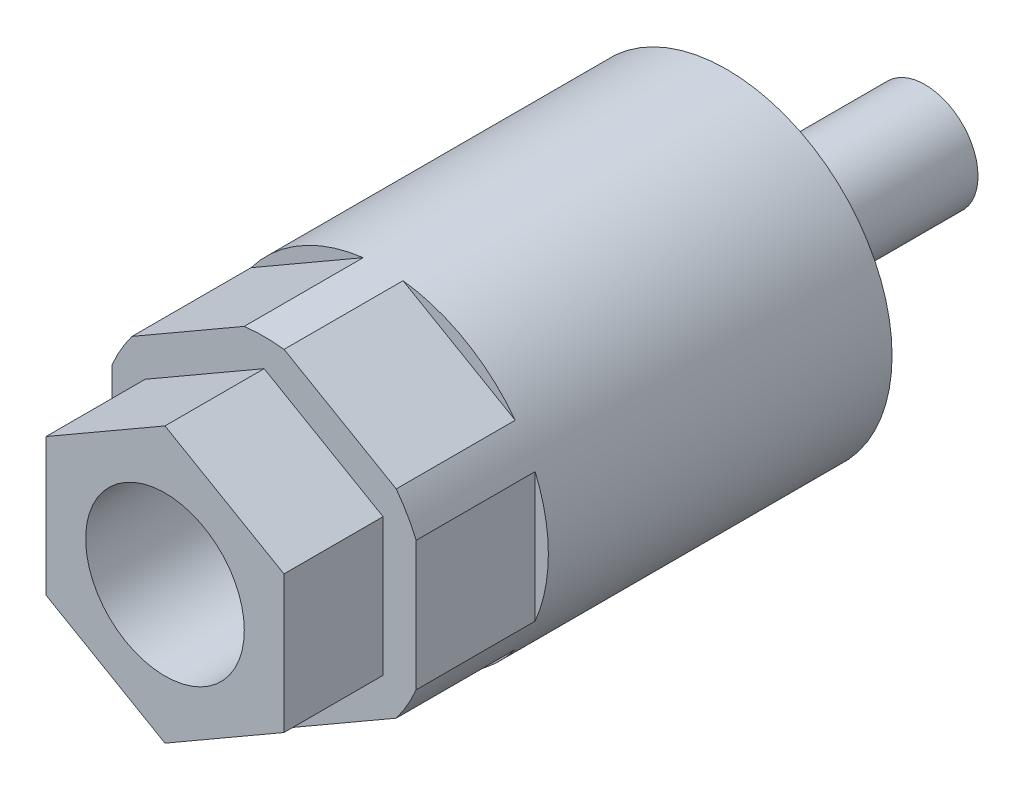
ISO-10303-21;
HEADER;
FILE_DESCRIPTION(('STEP AP214'),'2;1');
FILE_NAME('part.step','',(''),(''),'','','');
FILE_SCHEMA(('AUTOMOTIVE_DESIGN { 1 0 10303 214 1 1 1 1 }'));
ENDSEC;
DATA;
#1=APPLICATION_CONTEXT('core data for automotive mechanical design processes');
#2=APPLICATION_PROTOCOL_DEFINITION('international standard','automotive_design',2000,#1);
#3=PRODUCT_CONTEXT('',#1,'mechanical');
#4=PRODUCT('Part','Part','',(#3));
#5=PRODUCT_RELATED_PRODUCT_CATEGORY('part','',(#4));
#6=PRODUCT_DEFINITION_FORMATION('','',#4);
#7=PRODUCT_DEFINITION_CONTEXT('part definition',#1,'design');
#8=PRODUCT_DEFINITION('design','',#6,#7);
#9=PRODUCT_DEFINITION_SHAPE('','',#8);
#10=(LENGTH_UNIT() NAMED_UNIT(*) SI_UNIT(.MILLI.,.METRE.));
#11=(NAMED_UNIT(*) PLANE_ANGLE_UNIT() SI_UNIT($,.RADIAN.));
#12=(NAMED_UNIT(*) SI_UNIT($,.STERADIAN.) SOLID_ANGLE_UNIT());
#13=UNCERTAINTY_MEASURE_WITH_UNIT(LENGTH_MEASURE(1.E-05),#10,'distance_accuracy_value','');
#14=(GEOMETRIC_REPRESENTATION_CONTEXT(3) GLOBAL_UNCERTAINTY_ASSIGNED_CONTEXT((#13)) GLOBAL_UNIT_ASSIGNED_CONTEXT((#10,
#11,#12)) REPRESENTATION_CONTEXT('',''));
#15=CARTESIAN_POINT('',(0.,0.,0.));
#16=DIRECTION('',(0.,0.,1.));
#17=DIRECTION('',(1.,0.,0.));
#18=AXIS2_PLACEMENT_3D('',#15,#16,#17);
#19=CARTESIAN_POINT('',(0.,0.,80.));
#20=DIRECTION('',(0.,0.,1.));
#21=DIRECTION('',(1.,0.,0.));
#22=AXIS2_PLACEMENT_3D('',#19,#20,#21);
#23=CYLINDRICAL_SURFACE('',#22,25.);
#24=CARTESIAN_POINT('',(0.,0.,0.));
#25=DIRECTION('',(0.,0.,1.));
#26=DIRECTION('',(1.,0.,0.));
#27=AXIS2_PLACEMENT_3D('',#24,#25,#26);
#28=CIRCLE('',#27,25.);
#29=CARTESIAN_POINT('',(25.,0.,0.));
#30=VERTEX_POINT('',#29);
#31=EDGE_CURVE('E216',#30,#30,#28,.T.);
#32=ORIENTED_EDGE('',*,*,#31,.T.);
#33=EDGE_LOOP('',(#32));
#34=FACE_BOUND('',#33,.T.);
#35=DIRECTION('',(0.,0.,1.));
#36=VECTOR('',#35,1.);
#37=CARTESIAN_POINT('',(23.,-9.79795897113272,80.));
#38=LINE('',#37,#36);
#39=CARTESIAN_POINT('',(23.,-9.79795897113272,52.));
#40=VERTEX_POINT('',#39);
#41=CARTESIAN_POINT('',(23.,-9.79795897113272,70.));
#42=VERTEX_POINT('',#41);
#43=EDGE_CURVE('E269',#40,#42,#38,.T.);
#44=ORIENTED_EDGE('',*,*,#43,.T.);
#45=CARTESIAN_POINT('',(0.,0.,70.));
#46=DIRECTION('',(0.,0.,1.));
#47=DIRECTION('',(1.,0.,0.));
#48=AXIS2_PLACEMENT_3D('',#45,#46,#47);
#49=CIRCLE('',#48,25.);
#50=CARTESIAN_POINT('',(19.9852813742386,-15.0196048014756,70.));
#51=VERTEX_POINT('',#50);
#52=EDGE_CURVE('E206',#42,#51,#49,.F.);
#53=ORIENTED_EDGE('',*,*,#52,.T.);
#54=DIRECTION('',(0.,0.,1.));
#55=VECTOR('',#54,1.);
#56=CARTESIAN_POINT('',(19.9852813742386,-15.0196048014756,80.));
#57=LINE('',#56,#55);
#58=CARTESIAN_POINT('',(19.9852813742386,-15.0196048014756,52.));
#59=VERTEX_POINT('',#58);
#60=EDGE_CURVE('E263',#59,#51,#57,.T.);
#61=ORIENTED_EDGE('',*,*,#60,.F.);
#62=CARTESIAN_POINT('',(0.,0.,52.));
#63=DIRECTION('',(0.,0.,1.));
#64=DIRECTION('',(1.,0.,0.));
#65=AXIS2_PLACEMENT_3D('',#62,#63,#64);
#66=CIRCLE('',#65,25.);
#67=CARTESIAN_POINT('',(3.01471862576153,-24.8175637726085,52.));
#68=VERTEX_POINT('',#67);
#69=EDGE_CURVE('E266',#59,#68,#66,.F.);
#70=ORIENTED_EDGE('',*,*,#69,.T.);
#71=DIRECTION('',(0.,0.,1.));
#72=VECTOR('',#71,1.);
#73=CARTESIAN_POINT('',(3.01471862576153,-24.8175637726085,80.));
#74=LINE('',#73,#72);
#75=CARTESIAN_POINT('',(3.01471862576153,-24.8175637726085,70.));
#76=VERTEX_POINT('',#75);
#77=EDGE_CURVE('E267',#76,#68,#74,.F.);
#78=ORIENTED_EDGE('',*,*,#77,.F.);
#79=CARTESIAN_POINT('',(-3.01471862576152,-24.8175637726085,70.));
#80=VERTEX_POINT('',#79);
#81=EDGE_CURVE('E196',#76,#80,#49,.F.);
#82=ORIENTED_EDGE('',*,*,#81,.T.);
#83=DIRECTION('',(0.,0.,1.));
#84=VECTOR('',#83,1.);
#85=CARTESIAN_POINT('',(-3.01471862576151,-24.8175637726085,80.));
#86=LINE('',#85,#84);
#87=CARTESIAN_POINT('',(-3.01471862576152,-24.8175637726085,52.));
#88=VERTEX_POINT('',#87);
#89=EDGE_CURVE('E261',#80,#88,#86,.F.);
#90=ORIENTED_EDGE('',*,*,#89,.T.);
#91=CARTESIAN_POINT('',(-19.9852813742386,-15.0196048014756,52.));
#92=VERTEX_POINT('',#91);
#93=EDGE_CURVE('E260',#88,#92,#66,.F.);
#94=ORIENTED_EDGE('',*,*,#93,.T.);
#95=DIRECTION('',(0.,0.,1.));
#96=VECTOR('',#95,1.);
#97=CARTESIAN_POINT('',(-19.9852813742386,-15.0196048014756,80.));
#98=LINE('',#97,#96);
#99=CARTESIAN_POINT('',(-19.9852813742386,-15.0196048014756,70.));
#100=VERTEX_POINT('',#99);
#101=EDGE_CURVE('E257',#92,#100,#98,.T.);
#102=ORIENTED_EDGE('',*,*,#101,.T.);
#103=CARTESIAN_POINT('',(-23.,-9.79795897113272,70.));
#104=VERTEX_POINT('',#103);
#105=EDGE_CURVE('E208',#100,#104,#49,.F.);
#106=ORIENTED_EDGE('',*,*,#105,.T.);
#107=DIRECTION('',(0.,0.,1.));
#108=VECTOR('',#107,1.);
#109=CARTESIAN_POINT('',(-23.,-9.79795897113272,80.));
#110=LINE('',#109,#108);
#111=CARTESIAN_POINT('',(-23.,-9.79795897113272,52.));
#112=VERTEX_POINT('',#111);
#113=EDGE_CURVE('E252',#112,#104,#110,.T.);
#114=ORIENTED_EDGE('',*,*,#113,.F.);
#115=CARTESIAN_POINT('',(-23.,9.79795897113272,52.));
#116=VERTEX_POINT('',#115);
#117=EDGE_CURVE('E250',#112,#116,#66,.F.);
#118=ORIENTED_EDGE('',*,*,#117,.T.);
#119=DIRECTION('',(0.,0.,1.));
#120=VECTOR('',#119,1.);
#121=CARTESIAN_POINT('',(-23.,9.79795897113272,80.));
#122=LINE('',#121,#120);
#123=CARTESIAN_POINT('',(-23.,9.79795897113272,70.));
#124=VERTEX_POINT('',#123);
#125=EDGE_CURVE('E255',#124,#116,#122,.F.);
#126=ORIENTED_EDGE('',*,*,#125,.F.);
#127=CARTESIAN_POINT('',(-19.9852813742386,15.0196048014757,70.));
#128=VERTEX_POINT('',#127);
#129=EDGE_CURVE('E202',#124,#128,#49,.F.);
#130=ORIENTED_EDGE('',*,*,#129,.T.);
#131=DIRECTION('',(0.,0.,1.));
#132=VECTOR('',#131,1.);
#133=CARTESIAN_POINT('',(-19.9852813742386,15.0196048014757,80.));
#134=LINE('',#133,#132);
#135=CARTESIAN_POINT('',(-19.9852813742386,15.0196048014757,52.));
#136=VERTEX_POINT('',#135);
#137=EDGE_CURVE('E242',#136,#128,#134,.T.);
#138=ORIENTED_EDGE('',*,*,#137,.F.);
#139=CARTESIAN_POINT('',(-3.01471862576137,24.8175637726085,52.));
#140=VERTEX_POINT('',#139);
#141=EDGE_CURVE('E245',#136,#140,#66,.F.);
#142=ORIENTED_EDGE('',*,*,#141,.T.);
#143=DIRECTION('',(0.,0.,1.));
#144=VECTOR('',#143,1.);
#145=CARTESIAN_POINT('',(-3.01471862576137,24.8175637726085,80.));
#146=LINE('',#145,#144);
#147=CARTESIAN_POINT('',(-3.01471862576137,24.8175637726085,70.));
#148=VERTEX_POINT('',#147);
#149=EDGE_CURVE('E248',#148,#140,#146,.F.);
#150=ORIENTED_EDGE('',*,*,#149,.F.);
#151=CARTESIAN_POINT('',(3.01471862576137,24.8175637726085,70.));
#152=VERTEX_POINT('',#151);
#153=EDGE_CURVE('E195',#148,#152,#49,.F.);
#154=ORIENTED_EDGE('',*,*,#153,.T.);
#155=DIRECTION('',(0.,0.,1.));
#156=VECTOR('',#155,1.);
#157=CARTESIAN_POINT('',(3.01471862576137,24.8175637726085,80.));
#158=LINE('',#157,#156);
#159=CARTESIAN_POINT('',(3.01471862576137,24.8175637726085,52.));
#160=VERTEX_POINT('',#159);
#161=EDGE_CURVE('E23',#152,#160,#158,.F.);
#162=ORIENTED_EDGE('',*,*,#161,.T.);
#163=CARTESIAN_POINT('',(19.9852813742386,15.0196048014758,52.));
#164=VERTEX_POINT('',#163);
#165=EDGE_CURVE('E249',#160,#164,#66,.F.);
#166=ORIENTED_EDGE('',*,*,#165,.T.);
#167=DIRECTION('',(0.,0.,1.));
#168=VECTOR('',#167,1.);
#169=CARTESIAN_POINT('',(19.9852813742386,15.0196048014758,80.));
#170=LINE('',#169,#168);
#171=CARTESIAN_POINT('',(19.9852813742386,15.0196048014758,70.));
#172=VERTEX_POINT('',#171);
#173=EDGE_CURVE('E275',#164,#172,#170,.T.);
#174=ORIENTED_EDGE('',*,*,#173,.T.);
#175=CARTESIAN_POINT('',(23.,9.79795897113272,70.));
#176=VERTEX_POINT('',#175);
#177=EDGE_CURVE('E38',#172,#176,#49,.F.);
#178=ORIENTED_EDGE('',*,*,#177,.T.);
#179=DIRECTION('',(0.,0.,1.));
#180=VECTOR('',#179,1.);
#181=CARTESIAN_POINT('',(23.,9.79795897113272,80.));
#182=LINE('',#181,#180);
#183=CARTESIAN_POINT('',(23.,9.79795897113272,52.));
#184=VERTEX_POINT('',#183);
#185=EDGE_CURVE('E273',#176,#184,#182,.F.);
#186=ORIENTED_EDGE('',*,*,#185,.T.);
#187=EDGE_CURVE('E272',#184,#40,#66,.F.);
#188=ORIENTED_EDGE('',*,*,#187,.T.);
#189=EDGE_LOOP('',(#44,#53,#61,#70,#78,#82,#90,#94,#102,#106,#114,#118,#126,#130,#138,#142,#150,
#154,#162,#166,#174,#178,#186,#188));
#190=FACE_BOUND('',#189,.T.);
#191=ADVANCED_FACE('F14',(#34,#190),#23,.T.);
#192=CARTESIAN_POINT('',(-23.,13.2790561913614,52.));
#193=DIRECTION('',(0.5,-0.86602540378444,0.));
#194=DIRECTION('',(0.86602540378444,0.5,0.));
#195=AXIS2_PLACEMENT_3D('',#192,#193,#194);
#196=PLANE('',#195);
#197=DIRECTION('',(-0.86602540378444,-0.5,0.));
#198=VECTOR('',#197,1.);
#199=CARTESIAN_POINT('',(-23.,13.2790561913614,70.));
#200=LINE('',#199,#198);
#201=EDGE_CURVE('E200',#148,#128,#200,.T.);
#202=ORIENTED_EDGE('',*,*,#201,.F.);
#203=ORIENTED_EDGE('',*,*,#149,.T.);
#204=DIRECTION('',(0.86602540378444,0.5,0.));
#205=VECTOR('',#204,1.);
#206=CARTESIAN_POINT('',(-23.,13.2790561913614,52.));
#207=LINE('',#206,#205);
#208=EDGE_CURVE('E226',#136,#140,#207,.T.);
#209=ORIENTED_EDGE('',*,*,#208,.F.);
#210=ORIENTED_EDGE('',*,*,#137,.T.);
#211=EDGE_LOOP('',(#202,#203,#209,#210));
#212=FACE_BOUND('',#211,.T.);
#213=ADVANCED_FACE('F333',(#212),#196,.F.);
#214=CARTESIAN_POINT('',(-23.,-13.2790561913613,52.));
#215=DIRECTION('',(1.,0.,0.));
#216=DIRECTION('',(0.,0.,-1.));
#217=AXIS2_PLACEMENT_3D('',#214,#215,#216);
#218=PLANE('',#217);
#219=DIRECTION('',(0.,-1.,0.));
#220=VECTOR('',#219,1.);
#221=CARTESIAN_POINT('',(-23.,-13.2790561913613,70.));
#222=LINE('',#221,#220);
#223=EDGE_CURVE('E205',#124,#104,#222,.T.);
#224=ORIENTED_EDGE('',*,*,#223,.F.);
#225=ORIENTED_EDGE('',*,*,#125,.T.);
#226=DIRECTION('',(0.,1.,0.));
#227=VECTOR('',#226,1.);
#228=CARTESIAN_POINT('',(-23.,-13.2790561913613,52.));
#229=LINE('',#228,#227);
#230=EDGE_CURVE('E223',#112,#116,#229,.T.);
#231=ORIENTED_EDGE('',*,*,#230,.F.);
#232=ORIENTED_EDGE('',*,*,#113,.T.);
#233=EDGE_LOOP('',(#224,#225,#231,#232));
#234=FACE_BOUND('',#233,.T.);
#235=ADVANCED_FACE('F301',(#234),#218,.F.);
#236=CARTESIAN_POINT('',(-23.,-13.2790561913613,52.));
#237=DIRECTION('',(-0.5,-0.866025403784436,0.));
#238=DIRECTION('',(0.866025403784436,-0.5,0.));
#239=AXIS2_PLACEMENT_3D('',#236,#237,#238);
#240=PLANE('',#239);
#241=ORIENTED_EDGE('',*,*,#89,.F.);
#242=DIRECTION('',(-0.866025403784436,0.5,0.));
#243=VECTOR('',#242,1.);
#244=CARTESIAN_POINT('',(-23.,-13.2790561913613,70.));
#245=LINE('',#244,#243);
#246=EDGE_CURVE('E209',#80,#100,#245,.T.);
#247=ORIENTED_EDGE('',*,*,#246,.T.);
#248=ORIENTED_EDGE('',*,*,#101,.F.);
#249=DIRECTION('',(0.866025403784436,-0.5,0.));
#250=VECTOR('',#249,1.);
#251=CARTESIAN_POINT('',(-23.,-13.2790561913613,52.));
#252=LINE('',#251,#250);
#253=EDGE_CURVE('E220',#92,#88,#252,.T.);
#254=ORIENTED_EDGE('',*,*,#253,.T.);
#255=EDGE_LOOP('',(#241,#247,#248,#254));
#256=FACE_BOUND('',#255,.T.);
#257=ADVANCED_FACE('F398',(#256),#240,.T.);
#258=CARTESIAN_POINT('',(23.,-13.2790561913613,52.));
#259=DIRECTION('',(-0.5,0.866025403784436,0.));
#260=DIRECTION('',(-0.866025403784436,-0.5,0.));
#261=AXIS2_PLACEMENT_3D('',#258,#259,#260);
#262=PLANE('',#261);
#263=DIRECTION('',(0.866025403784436,0.5,0.));
#264=VECTOR('',#263,1.);
#265=CARTESIAN_POINT('',(23.,-13.2790561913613,70.));
#266=LINE('',#265,#264);
#267=EDGE_CURVE('E203',#76,#51,#266,.T.);
#268=ORIENTED_EDGE('',*,*,#267,.F.);
#269=ORIENTED_EDGE('',*,*,#77,.T.);
#270=DIRECTION('',(-0.866025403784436,-0.5,0.));
#271=VECTOR('',#270,1.);
#272=CARTESIAN_POINT('',(23.,-13.2790561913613,52.));
#273=LINE('',#272,#271);
#274=EDGE_CURVE('E217',#59,#68,#273,.T.);
#275=ORIENTED_EDGE('',*,*,#274,.F.);
#276=ORIENTED_EDGE('',*,*,#60,.T.);
#277=EDGE_LOOP('',(#268,#269,#275,#276));
#278=FACE_BOUND('',#277,.T.);
#279=ADVANCED_FACE('F401',(#278),#262,.F.);
#280=CARTESIAN_POINT('',(23.,-13.2790561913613,52.));
#281=DIRECTION('',(1.,0.,0.));
#282=DIRECTION('',(0.,0.,-1.));
#283=AXIS2_PLACEMENT_3D('',#280,#281,#282);
#284=PLANE('',#283);
#285=ORIENTED_EDGE('',*,*,#185,.F.);
#286=DIRECTION('',(0.,-1.,0.));
#287=VECTOR('',#286,1.);
#288=CARTESIAN_POINT('',(23.,-13.2790561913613,70.));
#289=LINE('',#288,#287);
#290=EDGE_CURVE('E197',#176,#42,#289,.T.);
#291=ORIENTED_EDGE('',*,*,#290,.T.);
#292=ORIENTED_EDGE('',*,*,#43,.F.);
#293=DIRECTION('',(0.,1.,0.));
#294=VECTOR('',#293,1.);
#295=CARTESIAN_POINT('',(23.,-13.2790561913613,52.));
#296=LINE('',#295,#294);
#297=EDGE_CURVE('E213',#40,#184,#296,.T.);
#298=ORIENTED_EDGE('',*,*,#297,.T.);
#299=EDGE_LOOP('',(#285,#291,#292,#298));
#300=FACE_BOUND('',#299,.T.);
#301=ADVANCED_FACE('F394',(#300),#284,.T.);
#302=CARTESIAN_POINT('',(23.,13.2790561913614,52.));
#303=DIRECTION('',(0.5,0.86602540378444,0.));
#304=DIRECTION('',(-0.86602540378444,0.5,0.));
#305=AXIS2_PLACEMENT_3D('',#302,#303,#304);
#306=PLANE('',#305);
#307=ORIENTED_EDGE('',*,*,#161,.F.);
#308=DIRECTION('',(0.86602540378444,-0.5,0.));
#309=VECTOR('',#308,1.);
#310=CARTESIAN_POINT('',(23.,13.2790561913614,70.));
#311=LINE('',#310,#309);
#312=EDGE_CURVE('E9',#152,#172,#311,.T.);
#313=ORIENTED_EDGE('',*,*,#312,.T.);
#314=ORIENTED_EDGE('',*,*,#173,.F.);
#315=DIRECTION('',(-0.86602540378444,0.5,0.));
#316=VECTOR('',#315,1.);
#317=CARTESIAN_POINT('',(23.,13.2790561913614,52.));
#318=LINE('',#317,#316);
#319=EDGE_CURVE('E212',#164,#160,#318,.T.);
#320=ORIENTED_EDGE('',*,*,#319,.T.);
#321=EDGE_LOOP('',(#307,#313,#314,#320));
#322=FACE_BOUND('',#321,.T.);
#323=ADVANCED_FACE('F310',(#322),#306,.T.);
#324=CARTESIAN_POINT('',(0.,0.,80.));
#325=DIRECTION('',(0.,0.,1.));
#326=DIRECTION('',(1.,0.,0.));
#327=AXIS2_PLACEMENT_3D('',#324,#325,#326);
#328=CYLINDRICAL_SURFACE('',#327,8.);
#329=CARTESIAN_POINT('',(0.,0.,-30.));
#330=DIRECTION('',(0.,0.,1.));
#331=DIRECTION('',(0.,-1.,0.));
#332=AXIS2_PLACEMENT_3D('',#329,#330,#331);
#333=CIRCLE('',#332,8.);
#334=CARTESIAN_POINT('',(0.,-8.,-30.));
#335=VERTEX_POINT('',#334);
#336=EDGE_CURVE('E18',#335,#335,#333,.F.);
#337=ORIENTED_EDGE('',*,*,#336,.F.);
#338=EDGE_LOOP('',(#337));
#339=FACE_BOUND('',#338,.T.);
#340=CARTESIAN_POINT('',(0.,0.,0.));
#341=DIRECTION('',(0.,0.,1.));
#342=DIRECTION('',(1.,0.,0.));
#343=AXIS2_PLACEMENT_3D('',#340,#341,#342);
#344=CIRCLE('',#343,8.);
#345=CARTESIAN_POINT('',(8.,0.,0.));
#346=VERTEX_POINT('',#345);
#347=EDGE_CURVE('E233',#346,#346,#344,.T.);
#348=ORIENTED_EDGE('',*,*,#347,.F.);
#349=EDGE_LOOP('',(#348));
#350=FACE_BOUND('',#349,.T.);
#351=ADVANCED_FACE('F344',(#339,#350),#328,.T.);
#352=CARTESIAN_POINT('',(25.,0.,0.));
#353=DIRECTION('',(0.,0.,-1.));
#354=DIRECTION('',(-1.,0.,0.));
#355=AXIS2_PLACEMENT_3D('',#352,#353,#354);
#356=PLANE('',#355);
#357=ORIENTED_EDGE('',*,*,#347,.T.);
#358=EDGE_LOOP('',(#357));
#359=FACE_BOUND('',#358,.T.);
#360=ORIENTED_EDGE('',*,*,#31,.F.);
#361=EDGE_LOOP('',(#360));
#362=FACE_BOUND('',#361,.T.);
#363=ADVANCED_FACE('F330',(#359,#362),#356,.T.);
#364=CARTESIAN_POINT('',(0.,0.,52.));
#365=DIRECTION('',(0.,0.,1.));
#366=DIRECTION('',(1.,0.,0.));
#367=AXIS2_PLACEMENT_3D('',#364,#365,#366);
#368=PLANE('',#367);
#369=ORIENTED_EDGE('',*,*,#208,.T.);
#370=ORIENTED_EDGE('',*,*,#141,.F.);
#371=EDGE_LOOP('',(#369,#370));
#372=FACE_BOUND('',#371,.T.);
#373=ADVANCED_FACE('F317',(#372),#368,.T.);
#374=ORIENTED_EDGE('',*,*,#230,.T.);
#375=ORIENTED_EDGE('',*,*,#117,.F.);
#376=EDGE_LOOP('',(#374,#375));
#377=FACE_BOUND('',#376,.T.);
#378=ADVANCED_FACE('F298',(#377),#368,.T.);
#379=ORIENTED_EDGE('',*,*,#253,.F.);
#380=ORIENTED_EDGE('',*,*,#93,.F.);
#381=EDGE_LOOP('',(#379,#380));
#382=FACE_BOUND('',#381,.T.);
#383=ADVANCED_FACE('F416',(#382),#368,.T.);
#384=ORIENTED_EDGE('',*,*,#274,.T.);
#385=ORIENTED_EDGE('',*,*,#69,.F.);
#386=EDGE_LOOP('',(#384,#385));
#387=FACE_BOUND('',#386,.T.);
#388=ADVANCED_FACE('F325',(#387),#368,.T.);
#389=ORIENTED_EDGE('',*,*,#297,.F.);
#390=ORIENTED_EDGE('',*,*,#187,.F.);
#391=EDGE_LOOP('',(#389,#390));
#392=FACE_BOUND('',#391,.T.);
#393=ADVANCED_FACE('F315',(#392),#368,.T.);
#394=ORIENTED_EDGE('',*,*,#319,.F.);
#395=ORIENTED_EDGE('',*,*,#165,.F.);
#396=EDGE_LOOP('',(#394,#395));
#397=FACE_BOUND('',#396,.T.);
#398=ADVANCED_FACE('F313',(#397),#368,.T.);
#399=CARTESIAN_POINT('',(0.,0.,70.));
#400=DIRECTION('',(0.,0.,1.));
#401=DIRECTION('',(1.,0.,0.));
#402=AXIS2_PLACEMENT_3D('',#399,#400,#401);
#403=PLANE('',#402);
#404=ORIENTED_EDGE('',*,*,#81,.F.);
#405=ORIENTED_EDGE('',*,*,#267,.T.);
#406=ORIENTED_EDGE('',*,*,#52,.F.);
#407=ORIENTED_EDGE('',*,*,#290,.F.);
#408=ORIENTED_EDGE('',*,*,#177,.F.);
#409=ORIENTED_EDGE('',*,*,#312,.F.);
#410=ORIENTED_EDGE('',*,*,#153,.F.);
#411=ORIENTED_EDGE('',*,*,#201,.T.);
#412=ORIENTED_EDGE('',*,*,#129,.F.);
#413=ORIENTED_EDGE('',*,*,#223,.T.);
#414=ORIENTED_EDGE('',*,*,#105,.F.);
#415=ORIENTED_EDGE('',*,*,#246,.F.);
#416=EDGE_LOOP('',(#404,#405,#406,#407,#408,#409,#410,#411,#412,#413,#414,#415));
#417=FACE_BOUND('',#416,.T.);
#418=DIRECTION('',(-0.866025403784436,-0.5,0.));
#419=VECTOR('',#418,1.);
#420=CARTESIAN_POINT('',(18.,-10.3923048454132,70.));
#421=LINE('',#420,#419);
#422=CARTESIAN_POINT('',(18.,-10.3923048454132,70.));
#423=VERTEX_POINT('',#422);
#424=CARTESIAN_POINT('',(0.,-20.7846096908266,70.));
#425=VERTEX_POINT('',#424);
#426=EDGE_CURVE('E183',#423,#425,#421,.T.);
#427=ORIENTED_EDGE('',*,*,#426,.T.);
#428=DIRECTION('',(0.866025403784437,-0.5,0.));
#429=VECTOR('',#428,1.);
#430=CARTESIAN_POINT('',(-18.,-10.3923048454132,70.));
#431=LINE('',#430,#429);
#432=CARTESIAN_POINT('',(-18.,-10.3923048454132,70.));
#433=VERTEX_POINT('',#432);
#434=EDGE_CURVE('E147',#433,#425,#431,.T.);
#435=ORIENTED_EDGE('',*,*,#434,.F.);
#436=DIRECTION('',(0.,1.,0.));
#437=VECTOR('',#436,1.);
#438=CARTESIAN_POINT('',(-18.,-10.3923048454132,70.));
#439=LINE('',#438,#437);
#440=CARTESIAN_POINT('',(-18.,10.3923048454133,70.));
#441=VERTEX_POINT('',#440);
#442=EDGE_CURVE('E179',#433,#441,#439,.T.);
#443=ORIENTED_EDGE('',*,*,#442,.T.);
#444=DIRECTION('',(0.86602540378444,0.5,0.));
#445=VECTOR('',#444,1.);
#446=CARTESIAN_POINT('',(-18.,10.3923048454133,70.));
#447=LINE('',#446,#445);
#448=CARTESIAN_POINT('',(0.,20.7846096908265,70.));
#449=VERTEX_POINT('',#448);
#450=EDGE_CURVE('E176',#441,#449,#447,.T.);
#451=ORIENTED_EDGE('',*,*,#450,.T.);
#452=DIRECTION('',(-0.86602540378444,0.5,0.));
#453=VECTOR('',#452,1.);
#454=CARTESIAN_POINT('',(18.,10.3923048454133,70.));
#455=LINE('',#454,#453);
#456=CARTESIAN_POINT('',(18.,10.3923048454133,70.));
#457=VERTEX_POINT('',#456);
#458=EDGE_CURVE('E173',#457,#449,#455,.T.);
#459=ORIENTED_EDGE('',*,*,#458,.F.);
#460=DIRECTION('',(0.,1.,0.));
#461=VECTOR('',#460,1.);
#462=CARTESIAN_POINT('',(18.,-10.3923048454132,70.));
#463=LINE('',#462,#461);
#464=EDGE_CURVE('E170',#423,#457,#463,.T.);
#465=ORIENTED_EDGE('',*,*,#464,.F.);
#466=EDGE_LOOP('',(#427,#435,#443,#451,#459,#465));
#467=FACE_BOUND('',#466,.T.);
#468=ADVANCED_FACE('F302',(#417,#467),#403,.T.);
#469=CARTESIAN_POINT('',(18.,-10.3923048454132,70.));
#470=DIRECTION('',(-0.5,0.866025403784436,0.));
#471=DIRECTION('',(-0.866025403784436,-0.5,0.));
#472=AXIS2_PLACEMENT_3D('',#469,#470,#471);
#473=PLANE('',#472);
#474=DIRECTION('',(0.,0.,1.));
#475=VECTOR('',#474,1.);
#476=CARTESIAN_POINT('',(0.,-20.7846096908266,70.));
#477=LINE('',#476,#475);
#478=CARTESIAN_POINT('',(0.,-20.7846096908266,85.));
#479=VERTEX_POINT('',#478);
#480=EDGE_CURVE('E140',#425,#479,#477,.T.);
#481=ORIENTED_EDGE('',*,*,#480,.F.);
#482=ORIENTED_EDGE('',*,*,#426,.F.);
#483=DIRECTION('',(0.,0.,1.));
#484=VECTOR('',#483,1.);
#485=CARTESIAN_POINT('',(18.,-10.3923048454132,70.));
#486=LINE('',#485,#484);
#487=CARTESIAN_POINT('',(18.,-10.3923048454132,85.));
#488=VERTEX_POINT('',#487);
#489=EDGE_CURVE('E156',#423,#488,#486,.T.);
#490=ORIENTED_EDGE('',*,*,#489,.T.);
#491=DIRECTION('',(-0.866025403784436,-0.5,0.));
#492=VECTOR('',#491,1.);
#493=CARTESIAN_POINT('',(18.,-10.3923048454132,85.));
#494=LINE('',#493,#492);
#495=EDGE_CURVE('E154',#488,#479,#494,.T.);
#496=ORIENTED_EDGE('',*,*,#495,.T.);
#497=EDGE_LOOP('',(#481,#482,#490,#496));
#498=FACE_BOUND('',#497,.T.);
#499=ADVANCED_FACE('F155',(#498),#473,.F.);
#500=CARTESIAN_POINT('',(-18.,-10.3923048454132,70.));
#501=DIRECTION('',(-0.5,-0.866025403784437,0.));
#502=DIRECTION('',(0.866025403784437,-0.5,0.));
#503=AXIS2_PLACEMENT_3D('',#500,#501,#502);
#504=PLANE('',#503);
#505=DIRECTION('',(0.,0.,1.));
#506=VECTOR('',#505,1.);
#507=CARTESIAN_POINT('',(-18.,-10.3923048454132,70.));
#508=LINE('',#507,#506);
#509=CARTESIAN_POINT('',(-18.,-10.3923048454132,85.));
#510=VERTEX_POINT('',#509);
#511=EDGE_CURVE('E151',#433,#510,#508,.T.);
#512=ORIENTED_EDGE('',*,*,#511,.F.);
#513=ORIENTED_EDGE('',*,*,#434,.T.);
#514=ORIENTED_EDGE('',*,*,#480,.T.);
#515=DIRECTION('',(0.866025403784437,-0.5,0.));
#516=VECTOR('',#515,1.);
#517=CARTESIAN_POINT('',(-18.,-10.3923048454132,85.));
#518=LINE('',#517,#516);
#519=EDGE_CURVE('E144',#510,#479,#518,.T.);
#520=ORIENTED_EDGE('',*,*,#519,.F.);
#521=EDGE_LOOP('',(#512,#513,#514,#520));
#522=FACE_BOUND('',#521,.T.);
#523=ADVANCED_FACE('F142',(#522),#504,.T.);
#524=CARTESIAN_POINT('',(-18.,-10.3923048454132,70.));
#525=DIRECTION('',(1.,0.,0.));
#526=DIRECTION('',(0.,0.,-1.));
#527=AXIS2_PLACEMENT_3D('',#524,#525,#526);
#528=PLANE('',#527);
#529=DIRECTION('',(0.,0.,1.));
#530=VECTOR('',#529,1.);
#531=CARTESIAN_POINT('',(-18.,10.3923048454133,70.));
#532=LINE('',#531,#530);
#533=CARTESIAN_POINT('',(-18.,10.3923048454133,85.));
#534=VERTEX_POINT('',#533);
#535=EDGE_CURVE('E191',#441,#534,#532,.T.);
#536=ORIENTED_EDGE('',*,*,#535,.F.);
#537=ORIENTED_EDGE('',*,*,#442,.F.);
#538=ORIENTED_EDGE('',*,*,#511,.T.);
#539=DIRECTION('',(0.,1.,0.));
#540=VECTOR('',#539,1.);
#541=CARTESIAN_POINT('',(-18.,-10.3923048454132,85.));
#542=LINE('',#541,#540);
#543=EDGE_CURVE('E164',#510,#534,#542,.T.);
#544=ORIENTED_EDGE('',*,*,#543,.T.);
#545=EDGE_LOOP('',(#536,#537,#538,#544));
#546=FACE_BOUND('',#545,.T.);
#547=ADVANCED_FACE('F386',(#546),#528,.F.);
#548=CARTESIAN_POINT('',(-18.,10.3923048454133,70.));
#549=DIRECTION('',(0.5,-0.86602540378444,0.));
#550=DIRECTION('',(0.86602540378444,0.5,0.));
#551=AXIS2_PLACEMENT_3D('',#548,#549,#550);
#552=PLANE('',#551);
#553=DIRECTION('',(0.,0.,1.));
#554=VECTOR('',#553,1.);
#555=CARTESIAN_POINT('',(0.,20.7846096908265,70.));
#556=LINE('',#555,#554);
#557=CARTESIAN_POINT('',(0.,20.7846096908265,85.));
#558=VERTEX_POINT('',#557);
#559=EDGE_CURVE('E189',#449,#558,#556,.T.);
#560=ORIENTED_EDGE('',*,*,#559,.F.);
#561=ORIENTED_EDGE('',*,*,#450,.F.);
#562=ORIENTED_EDGE('',*,*,#535,.T.);
#563=DIRECTION('',(0.86602540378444,0.5,0.));
#564=VECTOR('',#563,1.);
#565=CARTESIAN_POINT('',(-18.,10.3923048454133,85.));
#566=LINE('',#565,#564);
#567=EDGE_CURVE('E166',#534,#558,#566,.T.);
#568=ORIENTED_EDGE('',*,*,#567,.T.);
#569=EDGE_LOOP('',(#560,#561,#562,#568));
#570=FACE_BOUND('',#569,.T.);
#571=ADVANCED_FACE('F383',(#570),#552,.F.);
#572=CARTESIAN_POINT('',(18.,10.3923048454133,70.));
#573=DIRECTION('',(0.5,0.86602540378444,0.));
#574=DIRECTION('',(-0.86602540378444,0.5,0.));
#575=AXIS2_PLACEMENT_3D('',#572,#573,#574);
#576=PLANE('',#575);
#577=DIRECTION('',(0.,0.,1.));
#578=VECTOR('',#577,1.);
#579=CARTESIAN_POINT('',(18.,10.3923048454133,70.));
#580=LINE('',#579,#578);
#581=CARTESIAN_POINT('',(18.,10.3923048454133,85.));
#582=VERTEX_POINT('',#581);
#583=EDGE_CURVE('E187',#457,#582,#580,.T.);
#584=ORIENTED_EDGE('',*,*,#583,.F.);
#585=ORIENTED_EDGE('',*,*,#458,.T.);
#586=ORIENTED_EDGE('',*,*,#559,.T.);
#587=DIRECTION('',(-0.86602540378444,0.5,0.));
#588=VECTOR('',#587,1.);
#589=CARTESIAN_POINT('',(18.,10.3923048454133,85.));
#590=LINE('',#589,#588);
#591=EDGE_CURVE('E30',#582,#558,#590,.T.);
#592=ORIENTED_EDGE('',*,*,#591,.F.);
#593=EDGE_LOOP('',(#584,#585,#586,#592));
#594=FACE_BOUND('',#593,.T.);
#595=ADVANCED_FACE('F379',(#594),#576,.T.);
#596=CARTESIAN_POINT('',(18.,-10.3923048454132,70.));
#597=DIRECTION('',(1.,0.,0.));
#598=DIRECTION('',(0.,0.,-1.));
#599=AXIS2_PLACEMENT_3D('',#596,#597,#598);
#600=PLANE('',#599);
#601=ORIENTED_EDGE('',*,*,#464,.T.);
#602=ORIENTED_EDGE('',*,*,#583,.T.);
#603=DIRECTION('',(0.,1.,0.));
#604=VECTOR('',#603,1.);
#605=CARTESIAN_POINT('',(18.,-10.3923048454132,85.));
#606=LINE('',#605,#604);
#607=EDGE_CURVE('E185',#488,#582,#606,.T.);
#608=ORIENTED_EDGE('',*,*,#607,.F.);
#609=ORIENTED_EDGE('',*,*,#489,.F.);
#610=EDGE_LOOP('',(#601,#602,#608,#609));
#611=FACE_BOUND('',#610,.T.);
#612=ADVANCED_FACE('F352',(#611),#600,.T.);
#613=CARTESIAN_POINT('',(12.,0.,8.));
#614=DIRECTION('',(0.,0.,-1.));
#615=DIRECTION('',(-1.,0.,0.));
#616=AXIS2_PLACEMENT_3D('',#613,#614,#615);
#617=PLANE('',#616);
#618=CARTESIAN_POINT('',(0.,0.,8.));
#619=DIRECTION('',(0.,0.,1.));
#620=DIRECTION('',(1.,0.,0.));
#621=AXIS2_PLACEMENT_3D('',#618,#619,#620);
#622=CIRCLE('',#621,12.);
#623=CARTESIAN_POINT('',(12.,0.,8.));
#624=VERTEX_POINT('',#623);
#625=EDGE_CURVE('E236',#624,#624,#622,.T.);
#626=ORIENTED_EDGE('',*,*,#625,.T.);
#627=EDGE_LOOP('',(#626));
#628=FACE_BOUND('',#627,.T.);
#629=ADVANCED_FACE('F349',(#628),#617,.F.);
#630=CARTESIAN_POINT('',(0.,0.,80.));
#631=DIRECTION('',(0.,0.,1.));
#632=DIRECTION('',(1.,0.,0.));
#633=AXIS2_PLACEMENT_3D('',#630,#631,#632);
#634=CYLINDRICAL_SURFACE('',#633,12.);
#635=ORIENTED_EDGE('',*,*,#625,.F.);
#636=EDGE_LOOP('',(#635));
#637=FACE_BOUND('',#636,.T.);
#638=CARTESIAN_POINT('',(0.,0.,85.));
#639=DIRECTION('',(0.,0.,1.));
#640=DIRECTION('',(1.,0.,0.));
#641=AXIS2_PLACEMENT_3D('',#638,#639,#640);
#642=CIRCLE('',#641,12.);
#643=CARTESIAN_POINT('',(12.,0.,85.));
#644=VERTEX_POINT('',#643);
#645=EDGE_CURVE('E239',#644,#644,#642,.T.);
#646=ORIENTED_EDGE('',*,*,#645,.T.);
#647=EDGE_LOOP('',(#646));
#648=FACE_BOUND('',#647,.T.);
#649=ADVANCED_FACE('F351',(#637,#648),#634,.F.);
#650=CARTESIAN_POINT('',(25.,0.,85.));
#651=DIRECTION('',(0.,0.,-1.));
#652=DIRECTION('',(-1.,0.,0.));
#653=AXIS2_PLACEMENT_3D('',#650,#651,#652);
#654=PLANE('',#653);
#655=ORIENTED_EDGE('',*,*,#519,.T.);
#656=ORIENTED_EDGE('',*,*,#495,.F.);
#657=ORIENTED_EDGE('',*,*,#607,.T.);
#658=ORIENTED_EDGE('',*,*,#591,.T.);
#659=ORIENTED_EDGE('',*,*,#567,.F.);
#660=ORIENTED_EDGE('',*,*,#543,.F.);
#661=EDGE_LOOP('',(#655,#656,#657,#658,#659,#660));
#662=FACE_BOUND('',#661,.T.);
#663=ORIENTED_EDGE('',*,*,#645,.F.);
#664=EDGE_LOOP('',(#663));
#665=FACE_BOUND('',#664,.T.);
#666=ADVANCED_FACE('F16',(#662,#665),#654,.F.);
#667=CARTESIAN_POINT('',(-20.,30.,-30.));
#668=DIRECTION('',(0.,0.,1.));
#669=DIRECTION('',(0.,-1.,0.));
#670=AXIS2_PLACEMENT_3D('',#667,#668,#669);
#671=PLANE('',#670);
#672=ORIENTED_EDGE('',*,*,#336,.T.);
#673=EDGE_LOOP('',(#672));
#674=FACE_BOUND('',#673,.T.);
#675=ADVANCED_FACE('F360',(#674),#671,.F.);
#676=CLOSED_SHELL('',(#191,#213,#235,#257,#279,#301,#323,#351,#363,#373,#378,#383,#388,#393,
#398,#468,#499,#523,#547,#571,#595,#612,#629,#649,#666,#675));
#677=MANIFOLD_SOLID_BREP('B1',#676);
#678=ADVANCED_BREP_SHAPE_REPRESENTATION('',(#18,#677),#14);
#679=SHAPE_DEFINITION_REPRESENTATION(#9,#678);
ENDSEC;
END-ISO-10303-21;
